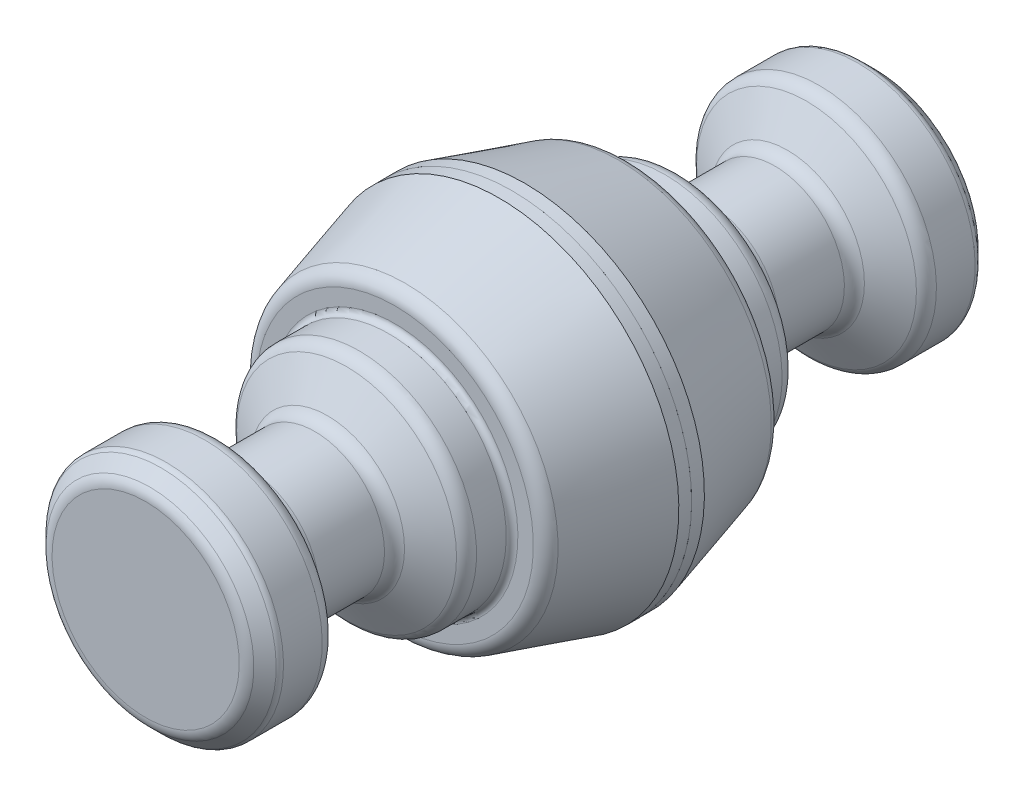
ISO-10303-21;
HEADER;
FILE_DESCRIPTION(('STEP AP214'),'2;1');
FILE_NAME('part.step','',(''),(''),'','','');
FILE_SCHEMA(('AUTOMOTIVE_DESIGN { 1 0 10303 214 1 1 1 1 }'));
ENDSEC;
DATA;
#1=APPLICATION_CONTEXT('core data for automotive mechanical design processes');
#2=APPLICATION_PROTOCOL_DEFINITION('international standard','automotive_design',2000,#1);
#3=PRODUCT_CONTEXT('',#1,'mechanical');
#4=PRODUCT('Part','Part','',(#3));
#5=PRODUCT_RELATED_PRODUCT_CATEGORY('part','',(#4));
#6=PRODUCT_DEFINITION_FORMATION('','',#4);
#7=PRODUCT_DEFINITION_CONTEXT('part definition',#1,'design');
#8=PRODUCT_DEFINITION('design','',#6,#7);
#9=PRODUCT_DEFINITION_SHAPE('','',#8);
#10=(LENGTH_UNIT() NAMED_UNIT(*) SI_UNIT(.MILLI.,.METRE.));
#11=(NAMED_UNIT(*) PLANE_ANGLE_UNIT() SI_UNIT($,.RADIAN.));
#12=(NAMED_UNIT(*) SI_UNIT($,.STERADIAN.) SOLID_ANGLE_UNIT());
#13=UNCERTAINTY_MEASURE_WITH_UNIT(LENGTH_MEASURE(1.E-05),#10,'distance_accuracy_value','');
#14=(GEOMETRIC_REPRESENTATION_CONTEXT(3) GLOBAL_UNCERTAINTY_ASSIGNED_CONTEXT((#13)) GLOBAL_UNIT_ASSIGNED_CONTEXT((#10,
#11,#12)) REPRESENTATION_CONTEXT('',''));
#15=CARTESIAN_POINT('',(0.,0.,0.));
#16=DIRECTION('',(0.,0.,1.));
#17=DIRECTION('',(1.,0.,0.));
#18=AXIS2_PLACEMENT_3D('',#15,#16,#17);
#19=CARTESIAN_POINT('',(0.,0.,0.));
#20=DIRECTION('',(0.,0.,-1.));
#21=DIRECTION('',(0.,-1.,0.));
#22=AXIS2_PLACEMENT_3D('',#19,#20,#21);
#23=CYLINDRICAL_SURFACE('',#22,4.75);
#24=CARTESIAN_POINT('',(0.,0.,13.4537386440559));
#25=DIRECTION('',(0.,0.,-1.));
#26=DIRECTION('',(0.,-1.,0.));
#27=AXIS2_PLACEMENT_3D('',#24,#25,#26);
#28=CIRCLE('',#27,4.75);
#29=CARTESIAN_POINT('',(0.,-4.75,13.4537386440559));
#30=VERTEX_POINT('',#29);
#31=EDGE_CURVE('E85',#30,#30,#28,.F.);
#32=ORIENTED_EDGE('',*,*,#31,.T.);
#33=EDGE_LOOP('',(#32));
#34=FACE_BOUND('',#33,.T.);
#35=CARTESIAN_POINT('',(0.,0.,17.9226497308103));
#36=DIRECTION('',(0.,0.,-1.));
#37=DIRECTION('',(0.,-1.,0.));
#38=AXIS2_PLACEMENT_3D('',#35,#36,#37);
#39=CIRCLE('',#38,4.75);
#40=CARTESIAN_POINT('',(0.,-4.75,17.9226497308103));
#41=VERTEX_POINT('',#40);
#42=EDGE_CURVE('E118',#41,#41,#39,.T.);
#43=ORIENTED_EDGE('',*,*,#42,.T.);
#44=EDGE_LOOP('',(#43));
#45=FACE_BOUND('',#44,.T.);
#46=ADVANCED_FACE('F12',(#34,#45),#23,.T.);
#47=CARTESIAN_POINT('',(0.,0.,0.));
#48=DIRECTION('',(0.,0.,-1.));
#49=DIRECTION('',(0.,-1.,0.));
#50=AXIS2_PLACEMENT_3D('',#47,#48,#49);
#51=CYLINDRICAL_SURFACE('',#50,8.);
#52=CARTESIAN_POINT('',(0.,0.,20.9537386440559));
#53=DIRECTION('',(0.,0.,1.));
#54=DIRECTION('',(0.,1.,0.));
#55=AXIS2_PLACEMENT_3D('',#52,#53,#54);
#56=CIRCLE('',#55,8.);
#57=CARTESIAN_POINT('',(0.,8.,20.9537386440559));
#58=VERTEX_POINT('',#57);
#59=EDGE_CURVE('E8',#58,#58,#56,.T.);
#60=ORIENTED_EDGE('',*,*,#59,.T.);
#61=EDGE_LOOP('',(#60));
#62=FACE_BOUND('',#61,.T.);
#63=CARTESIAN_POINT('',(0.,0.,23.5928932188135));
#64=DIRECTION('',(0.,0.,1.));
#65=DIRECTION('',(0.,1.,0.));
#66=AXIS2_PLACEMENT_3D('',#63,#64,#65);
#67=CIRCLE('',#66,8.);
#68=CARTESIAN_POINT('',(0.,8.,23.5928932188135));
#69=VERTEX_POINT('',#68);
#70=EDGE_CURVE('E112',#69,#69,#67,.F.);
#71=ORIENTED_EDGE('',*,*,#70,.T.);
#72=EDGE_LOOP('',(#71));
#73=FACE_BOUND('',#72,.T.);
#74=ADVANCED_FACE('F174',(#62,#73),#51,.T.);
#75=CARTESIAN_POINT('',(0.,0.,18.5));
#76=DIRECTION('',(0.,0.,1.));
#77=DIRECTION('',(0.,1.,0.));
#78=AXIS2_PLACEMENT_3D('',#75,#76,#77);
#79=CONICAL_SURFACE('',#78,4.75,1.0471975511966);
#80=CARTESIAN_POINT('',(0.,0.,20.0877132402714));
#81=DIRECTION('',(0.,0.,-1.));
#82=DIRECTION('',(0.,-1.,0.));
#83=AXIS2_PLACEMENT_3D('',#80,#81,#82);
#84=CIRCLE('',#83,7.5);
#85=CARTESIAN_POINT('',(0.,-7.5,20.0877132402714));
#86=VERTEX_POINT('',#85);
#87=EDGE_CURVE('E19',#86,#86,#84,.T.);
#88=ORIENTED_EDGE('',*,*,#87,.T.);
#89=EDGE_LOOP('',(#88));
#90=FACE_BOUND('',#89,.T.);
#91=CARTESIAN_POINT('',(0.,0.,18.7886751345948));
#92=DIRECTION('',(0.,0.,1.));
#93=DIRECTION('',(0.,1.,0.));
#94=AXIS2_PLACEMENT_3D('',#91,#92,#93);
#95=CIRCLE('',#94,5.25);
#96=CARTESIAN_POINT('',(0.,5.25,18.7886751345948));
#97=VERTEX_POINT('',#96);
#98=EDGE_CURVE('E115',#97,#97,#95,.T.);
#99=ORIENTED_EDGE('',*,*,#98,.T.);
#100=EDGE_LOOP('',(#99));
#101=FACE_BOUND('',#100,.T.);
#102=ADVANCED_FACE('F181',(#90,#101),#79,.T.);
#103=CARTESIAN_POINT('',(0.,0.,23.8));
#104=DIRECTION('',(0.,0.,-1.));
#105=DIRECTION('',(0.,-1.,0.));
#106=AXIS2_PLACEMENT_3D('',#103,#104,#105);
#107=CONICAL_SURFACE('',#106,8.,0.785398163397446);
#108=CARTESIAN_POINT('',(0.,0.,24.7071067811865));
#109=DIRECTION('',(0.,0.,1.));
#110=DIRECTION('',(0.,1.,0.));
#111=AXIS2_PLACEMENT_3D('',#108,#109,#110);
#112=CIRCLE('',#111,7.09289321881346);
#113=CARTESIAN_POINT('',(0.,7.09289321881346,24.7071067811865));
#114=VERTEX_POINT('',#113);
#115=EDGE_CURVE('E106',#114,#114,#112,.F.);
#116=ORIENTED_EDGE('',*,*,#115,.T.);
#117=EDGE_LOOP('',(#116));
#118=FACE_BOUND('',#117,.T.);
#119=CARTESIAN_POINT('',(0.,0.,23.9464466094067));
#120=DIRECTION('',(0.,0.,1.));
#121=DIRECTION('',(0.,1.,0.));
#122=AXIS2_PLACEMENT_3D('',#119,#120,#121);
#123=CIRCLE('',#122,7.85355339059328);
#124=CARTESIAN_POINT('',(0.,7.85355339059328,23.9464466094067));
#125=VERTEX_POINT('',#124);
#126=EDGE_CURVE('E109',#125,#125,#123,.T.);
#127=ORIENTED_EDGE('',*,*,#126,.T.);
#128=EDGE_LOOP('',(#127));
#129=FACE_BOUND('',#128,.T.);
#130=ADVANCED_FACE('F190',(#118,#129),#107,.T.);
#131=CARTESIAN_POINT('',(-9.,0.,25.));
#132=DIRECTION('',(0.,0.,1.));
#133=DIRECTION('',(0.,1.,0.));
#134=AXIS2_PLACEMENT_3D('',#131,#132,#133);
#135=PLANE('',#134);
#136=CARTESIAN_POINT('',(0.,0.,25.));
#137=DIRECTION('',(0.,0.,1.));
#138=DIRECTION('',(0.,1.,0.));
#139=AXIS2_PLACEMENT_3D('',#136,#137,#138);
#140=CIRCLE('',#139,6.38578643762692);
#141=CARTESIAN_POINT('',(0.,6.38578643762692,25.));
#142=VERTEX_POINT('',#141);
#143=EDGE_CURVE('E103',#142,#142,#140,.T.);
#144=ORIENTED_EDGE('',*,*,#143,.T.);
#145=EDGE_LOOP('',(#144));
#146=FACE_BOUND('',#145,.T.);
#147=ADVANCED_FACE('F186',(#146),#135,.T.);
#148=CARTESIAN_POINT('',(0.,0.,17.9226497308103));
#149=DIRECTION('',(0.,0.,-1.));
#150=DIRECTION('',(0.,-1.,0.));
#151=AXIS2_PLACEMENT_3D('',#148,#149,#150);
#152=TOROIDAL_SURFACE('',#151,5.75,1.);
#153=ORIENTED_EDGE('',*,*,#98,.F.);
#154=EDGE_LOOP('',(#153));
#155=FACE_BOUND('',#154,.T.);
#156=ORIENTED_EDGE('',*,*,#42,.F.);
#157=EDGE_LOOP('',(#156));
#158=FACE_BOUND('',#157,.T.);
#159=ADVANCED_FACE('F189',(#155,#158),#152,.F.);
#160=CARTESIAN_POINT('',(0.,0.,23.5928932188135));
#161=DIRECTION('',(0.,0.,1.));
#162=DIRECTION('',(0.,1.,0.));
#163=AXIS2_PLACEMENT_3D('',#160,#161,#162);
#164=TOROIDAL_SURFACE('',#163,7.5,0.5);
#165=ORIENTED_EDGE('',*,*,#126,.F.);
#166=EDGE_LOOP('',(#165));
#167=FACE_BOUND('',#166,.T.);
#168=ORIENTED_EDGE('',*,*,#70,.F.);
#169=EDGE_LOOP('',(#168));
#170=FACE_BOUND('',#169,.T.);
#171=ADVANCED_FACE('F194',(#167,#170),#164,.T.);
#172=CARTESIAN_POINT('',(0.,0.,24.));
#173=DIRECTION('',(0.,0.,1.));
#174=DIRECTION('',(0.,1.,0.));
#175=AXIS2_PLACEMENT_3D('',#172,#173,#174);
#176=TOROIDAL_SURFACE('',#175,6.38578643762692,1.);
#177=ORIENTED_EDGE('',*,*,#143,.F.);
#178=EDGE_LOOP('',(#177));
#179=FACE_BOUND('',#178,.T.);
#180=ORIENTED_EDGE('',*,*,#115,.F.);
#181=EDGE_LOOP('',(#180));
#182=FACE_BOUND('',#181,.T.);
#183=ADVANCED_FACE('F198',(#179,#182),#176,.T.);
#184=CARTESIAN_POINT('',(0.,0.,12.8763883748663));
#185=DIRECTION('',(0.,0.,-1.));
#186=DIRECTION('',(0.,-1.,0.));
#187=AXIS2_PLACEMENT_3D('',#184,#185,#186);
#188=CONICAL_SURFACE('',#187,4.75,1.0471975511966);
#189=CARTESIAN_POINT('',(0.,0.,11.2886751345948));
#190=DIRECTION('',(0.,0.,1.));
#191=DIRECTION('',(0.,1.,0.));
#192=AXIS2_PLACEMENT_3D('',#189,#190,#191);
#193=CIRCLE('',#192,7.5);
#194=CARTESIAN_POINT('',(0.,7.5,11.2886751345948));
#195=VERTEX_POINT('',#194);
#196=EDGE_CURVE('E88',#195,#195,#193,.T.);
#197=ORIENTED_EDGE('',*,*,#196,.T.);
#198=EDGE_LOOP('',(#197));
#199=FACE_BOUND('',#198,.T.);
#200=CARTESIAN_POINT('',(0.,0.,12.5877132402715));
#201=DIRECTION('',(0.,0.,1.));
#202=DIRECTION('',(0.,1.,0.));
#203=AXIS2_PLACEMENT_3D('',#200,#201,#202);
#204=CIRCLE('',#203,5.25);
#205=CARTESIAN_POINT('',(0.,5.25,12.5877132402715));
#206=VERTEX_POINT('',#205);
#207=EDGE_CURVE('E91',#206,#206,#204,.F.);
#208=ORIENTED_EDGE('',*,*,#207,.T.);
#209=EDGE_LOOP('',(#208));
#210=FACE_BOUND('',#209,.T.);
#211=ADVANCED_FACE('F202',(#199,#210),#188,.T.);
#212=CARTESIAN_POINT('',(0.,0.,0.));
#213=DIRECTION('',(0.,0.,-1.));
#214=DIRECTION('',(0.,-1.,0.));
#215=AXIS2_PLACEMENT_3D('',#212,#213,#214);
#216=CYLINDRICAL_SURFACE('',#215,8.);
#217=CARTESIAN_POINT('',(0.,0.,8.4));
#218=DIRECTION('',(0.,0.,-1.));
#219=DIRECTION('',(0.,-1.,0.));
#220=AXIS2_PLACEMENT_3D('',#217,#218,#219);
#221=CIRCLE('',#220,8.);
#222=CARTESIAN_POINT('',(0.,-8.,8.4));
#223=VERTEX_POINT('',#222);
#224=EDGE_CURVE('E82',#223,#223,#221,.F.);
#225=ORIENTED_EDGE('',*,*,#224,.T.);
#226=EDGE_LOOP('',(#225));
#227=FACE_BOUND('',#226,.T.);
#228=CARTESIAN_POINT('',(0.,0.,10.4226497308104));
#229=DIRECTION('',(0.,0.,1.));
#230=DIRECTION('',(0.,1.,0.));
#231=AXIS2_PLACEMENT_3D('',#228,#229,#230);
#232=CIRCLE('',#231,8.);
#233=CARTESIAN_POINT('',(0.,8.,10.4226497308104));
#234=VERTEX_POINT('',#233);
#235=EDGE_CURVE('E94',#234,#234,#232,.F.);
#236=ORIENTED_EDGE('',*,*,#235,.T.);
#237=EDGE_LOOP('',(#236));
#238=FACE_BOUND('',#237,.T.);
#239=ADVANCED_FACE('F279',(#227,#238),#216,.T.);
#240=CARTESIAN_POINT('',(0.,0.,0.));
#241=DIRECTION('',(0.,0.,-1.));
#242=DIRECTION('',(0.,-1.,0.));
#243=AXIS2_PLACEMENT_3D('',#240,#241,#242);
#244=CYLINDRICAL_SURFACE('',#243,12.25);
#245=CARTESIAN_POINT('',(0.,0.,0.));
#246=DIRECTION('',(0.,0.,1.));
#247=DIRECTION('',(0.,1.,0.));
#248=AXIS2_PLACEMENT_3D('',#245,#246,#247);
#249=CIRCLE('',#248,12.25);
#250=CARTESIAN_POINT('',(0.,12.25,0.));
#251=VERTEX_POINT('',#250);
#252=EDGE_CURVE('E125',#251,#251,#249,.T.);
#253=ORIENTED_EDGE('',*,*,#252,.T.);
#254=EDGE_LOOP('',(#253));
#255=FACE_BOUND('',#254,.T.);
#256=CARTESIAN_POINT('',(0.,0.,0.871853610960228));
#257=DIRECTION('',(0.,0.,-1.));
#258=DIRECTION('',(0.,-1.,0.));
#259=AXIS2_PLACEMENT_3D('',#256,#257,#258);
#260=CIRCLE('',#259,12.25);
#261=CARTESIAN_POINT('',(0.,-12.25,0.871853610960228));
#262=VERTEX_POINT('',#261);
#263=EDGE_CURVE('E36',#262,#262,#260,.T.);
#264=ORIENTED_EDGE('',*,*,#263,.T.);
#265=EDGE_LOOP('',(#264));
#266=FACE_BOUND('',#265,.T.);
#267=ADVANCED_FACE('F129',(#255,#266),#244,.T.);
#268=CARTESIAN_POINT('',(0.,0.,8.));
#269=DIRECTION('',(0.,0.,-1.));
#270=DIRECTION('',(0.,-1.,0.));
#271=AXIS2_PLACEMENT_3D('',#268,#269,#270);
#272=CONICAL_SURFACE('',#271,10.2060369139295,0.279252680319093);
#273=CARTESIAN_POINT('',(0.,0.,7.275637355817));
#274=DIRECTION('',(0.,0.,1.));
#275=DIRECTION('',(0.,1.,0.));
#276=AXIS2_PLACEMENT_3D('',#273,#274,#275);
#277=CIRCLE('',#276,10.4137445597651);
#278=CARTESIAN_POINT('',(0.,10.4137445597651,7.275637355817));
#279=VERTEX_POINT('',#278);
#280=EDGE_CURVE('E100',#279,#279,#277,.F.);
#281=ORIENTED_EDGE('',*,*,#280,.T.);
#282=EDGE_LOOP('',(#281));
#283=FACE_BOUND('',#282,.T.);
#284=ORIENTED_EDGE('',*,*,#263,.F.);
#285=EDGE_LOOP('',(#284));
#286=FACE_BOUND('',#285,.T.);
#287=ADVANCED_FACE('F208',(#283,#286),#272,.T.);
#288=CARTESIAN_POINT('',(0.,0.,7.));
#289=DIRECTION('',(0.,0.,-1.));
#290=DIRECTION('',(0.,-1.,0.));
#291=AXIS2_PLACEMENT_3D('',#288,#289,#290);
#292=TOROIDAL_SURFACE('',#291,9.45248286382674,1.);
#293=CARTESIAN_POINT('',(0.,0.,8.));
#294=DIRECTION('',(0.,0.,-1.));
#295=DIRECTION('',(0.,-1.,0.));
#296=AXIS2_PLACEMENT_3D('',#293,#294,#295);
#297=CIRCLE('',#296,9.45248286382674);
#298=CARTESIAN_POINT('',(0.,-9.45248286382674,8.));
#299=VERTEX_POINT('',#298);
#300=EDGE_CURVE('E97',#299,#299,#297,.F.);
#301=ORIENTED_EDGE('',*,*,#300,.F.);
#302=EDGE_LOOP('',(#301));
#303=FACE_BOUND('',#302,.T.);
#304=ORIENTED_EDGE('',*,*,#280,.F.);
#305=EDGE_LOOP('',(#304));
#306=FACE_BOUND('',#305,.T.);
#307=ADVANCED_FACE('F204',(#303,#306),#292,.T.);
#308=CARTESIAN_POINT('',(-10.2060369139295,0.,8.));
#309=DIRECTION('',(0.,0.,-1.));
#310=DIRECTION('',(0.,-1.,0.));
#311=AXIS2_PLACEMENT_3D('',#308,#309,#310);
#312=PLANE('',#311);
#313=CARTESIAN_POINT('',(0.,0.,8.));
#314=DIRECTION('',(0.,0.,-1.));
#315=DIRECTION('',(0.,-1.,0.));
#316=AXIS2_PLACEMENT_3D('',#313,#314,#315);
#317=CIRCLE('',#316,8.4);
#318=CARTESIAN_POINT('',(0.,-8.4,8.));
#319=VERTEX_POINT('',#318);
#320=EDGE_CURVE('E79',#319,#319,#317,.T.);
#321=ORIENTED_EDGE('',*,*,#320,.T.);
#322=EDGE_LOOP('',(#321));
#323=FACE_BOUND('',#322,.T.);
#324=ORIENTED_EDGE('',*,*,#300,.T.);
#325=EDGE_LOOP('',(#324));
#326=FACE_BOUND('',#325,.T.);
#327=ADVANCED_FACE('F207',(#323,#326),#312,.F.);
#328=CARTESIAN_POINT('',(0.,0.,10.4226497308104));
#329=DIRECTION('',(0.,0.,1.));
#330=DIRECTION('',(0.,1.,0.));
#331=AXIS2_PLACEMENT_3D('',#328,#329,#330);
#332=TOROIDAL_SURFACE('',#331,7.,1.);
#333=ORIENTED_EDGE('',*,*,#196,.F.);
#334=EDGE_LOOP('',(#333));
#335=FACE_BOUND('',#334,.T.);
#336=ORIENTED_EDGE('',*,*,#235,.F.);
#337=EDGE_LOOP('',(#336));
#338=FACE_BOUND('',#337,.T.);
#339=ADVANCED_FACE('F210',(#335,#338),#332,.T.);
#340=CARTESIAN_POINT('',(0.,0.,13.4537386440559));
#341=DIRECTION('',(0.,0.,-1.));
#342=DIRECTION('',(0.,-1.,0.));
#343=AXIS2_PLACEMENT_3D('',#340,#341,#342);
#344=TOROIDAL_SURFACE('',#343,5.75,1.);
#345=ORIENTED_EDGE('',*,*,#31,.F.);
#346=EDGE_LOOP('',(#345));
#347=FACE_BOUND('',#346,.T.);
#348=ORIENTED_EDGE('',*,*,#207,.F.);
#349=EDGE_LOOP('',(#348));
#350=FACE_BOUND('',#349,.T.);
#351=ADVANCED_FACE('F213',(#347,#350),#344,.F.);
#352=CARTESIAN_POINT('',(0.,0.,8.4));
#353=DIRECTION('',(0.,0.,-1.));
#354=DIRECTION('',(0.,-1.,0.));
#355=AXIS2_PLACEMENT_3D('',#352,#353,#354);
#356=TOROIDAL_SURFACE('',#355,8.4,0.4);
#357=ORIENTED_EDGE('',*,*,#320,.F.);
#358=EDGE_LOOP('',(#357));
#359=FACE_BOUND('',#358,.T.);
#360=ORIENTED_EDGE('',*,*,#224,.F.);
#361=EDGE_LOOP('',(#360));
#362=FACE_BOUND('',#361,.T.);
#363=ADVANCED_FACE('F142',(#359,#362),#356,.F.);
#364=CARTESIAN_POINT('',(0.,0.,0.));
#365=DIRECTION('',(0.,0.,1.));
#366=DIRECTION('',(0.,1.,0.));
#367=AXIS2_PLACEMENT_3D('',#364,#365,#366);
#368=CYLINDRICAL_SURFACE('',#367,12.2495);
#369=CARTESIAN_POINT('',(0.,0.,0.));
#370=DIRECTION('',(0.,0.,1.));
#371=DIRECTION('',(0.,1.,0.));
#372=AXIS2_PLACEMENT_3D('',#369,#370,#371);
#373=CIRCLE('',#372,12.2495);
#374=CARTESIAN_POINT('',(0.,12.2495,0.));
#375=VERTEX_POINT('',#374);
#376=EDGE_CURVE('E37',#375,#375,#373,.T.);
#377=ORIENTED_EDGE('',*,*,#376,.F.);
#378=EDGE_LOOP('',(#377));
#379=FACE_BOUND('',#378,.T.);
#380=CARTESIAN_POINT('',(0.,0.,-0.87359731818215));
#381=DIRECTION('',(0.,0.,1.));
#382=DIRECTION('',(0.,1.,0.));
#383=AXIS2_PLACEMENT_3D('',#380,#381,#382);
#384=CIRCLE('',#383,12.2495);
#385=CARTESIAN_POINT('',(0.,12.2495,-0.87359731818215));
#386=VERTEX_POINT('',#385);
#387=EDGE_CURVE('E33',#386,#386,#384,.F.);
#388=ORIENTED_EDGE('',*,*,#387,.F.);
#389=EDGE_LOOP('',(#388));
#390=FACE_BOUND('',#389,.T.);
#391=ADVANCED_FACE('F136',(#379,#390),#368,.T.);
#392=CARTESIAN_POINT('',(-12.25,0.,0.));
#393=DIRECTION('',(0.,0.,1.));
#394=DIRECTION('',(0.,1.,0.));
#395=AXIS2_PLACEMENT_3D('',#392,#393,#394);
#396=PLANE('',#395);
#397=ORIENTED_EDGE('',*,*,#252,.F.);
#398=EDGE_LOOP('',(#397));
#399=FACE_BOUND('',#398,.T.);
#400=ORIENTED_EDGE('',*,*,#376,.T.);
#401=EDGE_LOOP('',(#400));
#402=FACE_BOUND('',#401,.T.);
#403=ADVANCED_FACE('F132',(#399,#402),#396,.F.);
#404=CARTESIAN_POINT('',(-9.,0.,-25.));
#405=DIRECTION('',(0.,0.,-1.));
#406=DIRECTION('',(0.,1.,0.));
#407=AXIS2_PLACEMENT_3D('',#404,#405,#406);
#408=PLANE('',#407);
#409=CARTESIAN_POINT('',(0.,0.,-25.));
#410=DIRECTION('',(0.,0.,-1.));
#411=DIRECTION('',(0.,-1.,0.));
#412=AXIS2_PLACEMENT_3D('',#409,#410,#411);
#413=CIRCLE('',#412,6.38578643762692);
#414=CARTESIAN_POINT('',(0.,-6.38578643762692,-25.));
#415=VERTEX_POINT('',#414);
#416=EDGE_CURVE('E64',#415,#415,#413,.T.);
#417=ORIENTED_EDGE('',*,*,#416,.T.);
#418=EDGE_LOOP('',(#417));
#419=FACE_BOUND('',#418,.T.);
#420=ADVANCED_FACE('F135',(#419),#408,.T.);
#421=CARTESIAN_POINT('',(0.,0.,-24.));
#422=DIRECTION('',(0.,0.,-1.));
#423=DIRECTION('',(0.,-1.,0.));
#424=AXIS2_PLACEMENT_3D('',#421,#422,#423);
#425=TOROIDAL_SURFACE('',#424,6.38578643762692,1.);
#426=CARTESIAN_POINT('',(0.,0.,-24.7071067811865));
#427=DIRECTION('',(0.,0.,-1.));
#428=DIRECTION('',(0.,-1.,0.));
#429=AXIS2_PLACEMENT_3D('',#426,#427,#428);
#430=CIRCLE('',#429,7.09289321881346);
#431=CARTESIAN_POINT('',(0.,-7.09289321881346,-24.7071067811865));
#432=VERTEX_POINT('',#431);
#433=EDGE_CURVE('E61',#432,#432,#430,.F.);
#434=ORIENTED_EDGE('',*,*,#433,.F.);
#435=EDGE_LOOP('',(#434));
#436=FACE_BOUND('',#435,.T.);
#437=ORIENTED_EDGE('',*,*,#416,.F.);
#438=EDGE_LOOP('',(#437));
#439=FACE_BOUND('',#438,.T.);
#440=ADVANCED_FACE('F233',(#436,#439),#425,.T.);
#441=CARTESIAN_POINT('',(0.,0.,-23.8));
#442=DIRECTION('',(0.,0.,1.));
#443=DIRECTION('',(0.,-1.,0.));
#444=AXIS2_PLACEMENT_3D('',#441,#442,#443);
#445=CONICAL_SURFACE('',#444,8.,0.785398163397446);
#446=ORIENTED_EDGE('',*,*,#433,.T.);
#447=EDGE_LOOP('',(#446));
#448=FACE_BOUND('',#447,.T.);
#449=CARTESIAN_POINT('',(0.,0.,-23.9464466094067));
#450=DIRECTION('',(0.,0.,-1.));
#451=DIRECTION('',(0.,-1.,0.));
#452=AXIS2_PLACEMENT_3D('',#449,#450,#451);
#453=CIRCLE('',#452,7.85355339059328);
#454=CARTESIAN_POINT('',(0.,-7.85355339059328,-23.9464466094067));
#455=VERTEX_POINT('',#454);
#456=EDGE_CURVE('E70',#455,#455,#453,.T.);
#457=ORIENTED_EDGE('',*,*,#456,.T.);
#458=EDGE_LOOP('',(#457));
#459=FACE_BOUND('',#458,.T.);
#460=ADVANCED_FACE('F231',(#448,#459),#445,.T.);
#461=CARTESIAN_POINT('',(0.,0.,-23.5928932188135));
#462=DIRECTION('',(0.,0.,1.));
#463=DIRECTION('',(0.,1.,0.));
#464=AXIS2_PLACEMENT_3D('',#461,#462,#463);
#465=TOROIDAL_SURFACE('',#464,7.5,0.5);
#466=CARTESIAN_POINT('',(0.,0.,-23.5928932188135));
#467=DIRECTION('',(0.,0.,1.));
#468=DIRECTION('',(0.,1.,0.));
#469=AXIS2_PLACEMENT_3D('',#466,#467,#468);
#470=CIRCLE('',#469,8.);
#471=CARTESIAN_POINT('',(0.,8.,-23.5928932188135));
#472=VERTEX_POINT('',#471);
#473=EDGE_CURVE('E67',#472,#472,#470,.T.);
#474=ORIENTED_EDGE('',*,*,#473,.F.);
#475=EDGE_LOOP('',(#474));
#476=FACE_BOUND('',#475,.T.);
#477=ORIENTED_EDGE('',*,*,#456,.F.);
#478=EDGE_LOOP('',(#477));
#479=FACE_BOUND('',#478,.T.);
#480=ADVANCED_FACE('F227',(#476,#479),#465,.T.);
#481=CARTESIAN_POINT('',(0.,0.,0.));
#482=DIRECTION('',(0.,0.,1.));
#483=DIRECTION('',(0.,-1.,0.));
#484=AXIS2_PLACEMENT_3D('',#481,#482,#483);
#485=CYLINDRICAL_SURFACE('',#484,8.);
#486=CARTESIAN_POINT('',(0.,0.,-20.9537386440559));
#487=DIRECTION('',(0.,0.,1.));
#488=DIRECTION('',(0.,1.,0.));
#489=AXIS2_PLACEMENT_3D('',#486,#487,#488);
#490=CIRCLE('',#489,8.);
#491=CARTESIAN_POINT('',(0.,8.,-20.9537386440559));
#492=VERTEX_POINT('',#491);
#493=EDGE_CURVE('E27',#492,#492,#490,.F.);
#494=ORIENTED_EDGE('',*,*,#493,.T.);
#495=EDGE_LOOP('',(#494));
#496=FACE_BOUND('',#495,.T.);
#497=ORIENTED_EDGE('',*,*,#473,.T.);
#498=EDGE_LOOP('',(#497));
#499=FACE_BOUND('',#498,.T.);
#500=ADVANCED_FACE('F230',(#496,#499),#485,.T.);
#501=CARTESIAN_POINT('',(0.,0.,-18.5));
#502=DIRECTION('',(0.,0.,-1.));
#503=DIRECTION('',(0.,1.,0.));
#504=AXIS2_PLACEMENT_3D('',#501,#502,#503);
#505=CONICAL_SURFACE('',#504,4.75,1.0471975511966);
#506=CARTESIAN_POINT('',(0.,0.,-20.0877132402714));
#507=DIRECTION('',(0.,0.,1.));
#508=DIRECTION('',(0.,1.,0.));
#509=AXIS2_PLACEMENT_3D('',#506,#507,#508);
#510=CIRCLE('',#509,7.5);
#511=CARTESIAN_POINT('',(0.,7.5,-20.0877132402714));
#512=VERTEX_POINT('',#511);
#513=EDGE_CURVE('E23',#512,#512,#510,.T.);
#514=ORIENTED_EDGE('',*,*,#513,.T.);
#515=EDGE_LOOP('',(#514));
#516=FACE_BOUND('',#515,.T.);
#517=CARTESIAN_POINT('',(0.,0.,-18.7886751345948));
#518=DIRECTION('',(0.,0.,-1.));
#519=DIRECTION('',(0.,-1.,0.));
#520=AXIS2_PLACEMENT_3D('',#517,#518,#519);
#521=CIRCLE('',#520,5.25);
#522=CARTESIAN_POINT('',(0.,-5.25,-18.7886751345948));
#523=VERTEX_POINT('',#522);
#524=EDGE_CURVE('E76',#523,#523,#521,.T.);
#525=ORIENTED_EDGE('',*,*,#524,.T.);
#526=EDGE_LOOP('',(#525));
#527=FACE_BOUND('',#526,.T.);
#528=ADVANCED_FACE('F225',(#516,#527),#505,.T.);
#529=CARTESIAN_POINT('',(0.,0.,-17.9226497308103));
#530=DIRECTION('',(0.,0.,-1.));
#531=DIRECTION('',(0.,-1.,0.));
#532=AXIS2_PLACEMENT_3D('',#529,#530,#531);
#533=TOROIDAL_SURFACE('',#532,5.75,1.);
#534=CARTESIAN_POINT('',(0.,0.,-17.9226497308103));
#535=DIRECTION('',(0.,0.,-1.));
#536=DIRECTION('',(0.,-1.,0.));
#537=AXIS2_PLACEMENT_3D('',#534,#535,#536);
#538=CIRCLE('',#537,4.75);
#539=CARTESIAN_POINT('',(0.,-4.75,-17.9226497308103));
#540=VERTEX_POINT('',#539);
#541=EDGE_CURVE('E73',#540,#540,#538,.F.);
#542=ORIENTED_EDGE('',*,*,#541,.F.);
#543=EDGE_LOOP('',(#542));
#544=FACE_BOUND('',#543,.T.);
#545=ORIENTED_EDGE('',*,*,#524,.F.);
#546=EDGE_LOOP('',(#545));
#547=FACE_BOUND('',#546,.T.);
#548=ADVANCED_FACE('F221',(#544,#547),#533,.F.);
#549=CARTESIAN_POINT('',(0.,0.,0.));
#550=DIRECTION('',(0.,0.,1.));
#551=DIRECTION('',(0.,-1.,0.));
#552=AXIS2_PLACEMENT_3D('',#549,#550,#551);
#553=CYLINDRICAL_SURFACE('',#552,4.75);
#554=CARTESIAN_POINT('',(0.,0.,-13.4537386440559));
#555=DIRECTION('',(0.,0.,-1.));
#556=DIRECTION('',(0.,-1.,0.));
#557=AXIS2_PLACEMENT_3D('',#554,#555,#556);
#558=CIRCLE('',#557,4.75);
#559=CARTESIAN_POINT('',(0.,-4.75,-13.4537386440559));
#560=VERTEX_POINT('',#559);
#561=EDGE_CURVE('E43',#560,#560,#558,.T.);
#562=ORIENTED_EDGE('',*,*,#561,.T.);
#563=EDGE_LOOP('',(#562));
#564=FACE_BOUND('',#563,.T.);
#565=ORIENTED_EDGE('',*,*,#541,.T.);
#566=EDGE_LOOP('',(#565));
#567=FACE_BOUND('',#566,.T.);
#568=ADVANCED_FACE('F224',(#564,#567),#553,.T.);
#569=CARTESIAN_POINT('',(0.,0.,-13.4537386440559));
#570=DIRECTION('',(0.,0.,-1.));
#571=DIRECTION('',(0.,-1.,0.));
#572=AXIS2_PLACEMENT_3D('',#569,#570,#571);
#573=TOROIDAL_SURFACE('',#572,5.75,1.);
#574=CARTESIAN_POINT('',(0.,0.,-12.5877132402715));
#575=DIRECTION('',(0.,0.,-1.));
#576=DIRECTION('',(0.,-1.,0.));
#577=AXIS2_PLACEMENT_3D('',#574,#575,#576);
#578=CIRCLE('',#577,5.25);
#579=CARTESIAN_POINT('',(0.,-5.25,-12.5877132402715));
#580=VERTEX_POINT('',#579);
#581=EDGE_CURVE('E52',#580,#580,#578,.F.);
#582=ORIENTED_EDGE('',*,*,#581,.F.);
#583=EDGE_LOOP('',(#582));
#584=FACE_BOUND('',#583,.T.);
#585=ORIENTED_EDGE('',*,*,#561,.F.);
#586=EDGE_LOOP('',(#585));
#587=FACE_BOUND('',#586,.T.);
#588=ADVANCED_FACE('F242',(#584,#587),#573,.F.);
#589=CARTESIAN_POINT('',(0.,0.,-12.8763883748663));
#590=DIRECTION('',(0.,0.,1.));
#591=DIRECTION('',(0.,-1.,0.));
#592=AXIS2_PLACEMENT_3D('',#589,#590,#591);
#593=CONICAL_SURFACE('',#592,4.75,1.0471975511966);
#594=CARTESIAN_POINT('',(0.,0.,-11.2886751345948));
#595=DIRECTION('',(0.,0.,-1.));
#596=DIRECTION('',(0.,-1.,0.));
#597=AXIS2_PLACEMENT_3D('',#594,#595,#596);
#598=CIRCLE('',#597,7.5);
#599=CARTESIAN_POINT('',(0.,-7.5,-11.2886751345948));
#600=VERTEX_POINT('',#599);
#601=EDGE_CURVE('E49',#600,#600,#598,.T.);
#602=ORIENTED_EDGE('',*,*,#601,.T.);
#603=EDGE_LOOP('',(#602));
#604=FACE_BOUND('',#603,.T.);
#605=ORIENTED_EDGE('',*,*,#581,.T.);
#606=EDGE_LOOP('',(#605));
#607=FACE_BOUND('',#606,.T.);
#608=ADVANCED_FACE('F240',(#604,#607),#593,.T.);
#609=CARTESIAN_POINT('',(0.,0.,-10.4226497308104));
#610=DIRECTION('',(0.,0.,1.));
#611=DIRECTION('',(0.,1.,0.));
#612=AXIS2_PLACEMENT_3D('',#609,#610,#611);
#613=TOROIDAL_SURFACE('',#612,7.,1.);
#614=CARTESIAN_POINT('',(0.,0.,-10.4226497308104));
#615=DIRECTION('',(0.,0.,1.));
#616=DIRECTION('',(0.,1.,0.));
#617=AXIS2_PLACEMENT_3D('',#614,#615,#616);
#618=CIRCLE('',#617,8.);
#619=CARTESIAN_POINT('',(0.,8.,-10.4226497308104));
#620=VERTEX_POINT('',#619);
#621=EDGE_CURVE('E46',#620,#620,#618,.T.);
#622=ORIENTED_EDGE('',*,*,#621,.F.);
#623=EDGE_LOOP('',(#622));
#624=FACE_BOUND('',#623,.T.);
#625=ORIENTED_EDGE('',*,*,#601,.F.);
#626=EDGE_LOOP('',(#625));
#627=FACE_BOUND('',#626,.T.);
#628=ADVANCED_FACE('F237',(#624,#627),#613,.T.);
#629=CARTESIAN_POINT('',(0.,0.,0.));
#630=DIRECTION('',(0.,0.,1.));
#631=DIRECTION('',(0.,-1.,0.));
#632=AXIS2_PLACEMENT_3D('',#629,#630,#631);
#633=CYLINDRICAL_SURFACE('',#632,8.);
#634=CARTESIAN_POINT('',(0.,0.,-8.4));
#635=DIRECTION('',(0.,0.,1.));
#636=DIRECTION('',(0.,1.,0.));
#637=AXIS2_PLACEMENT_3D('',#634,#635,#636);
#638=CIRCLE('',#637,8.);
#639=CARTESIAN_POINT('',(0.,8.,-8.4));
#640=VERTEX_POINT('',#639);
#641=EDGE_CURVE('E40',#640,#640,#638,.F.);
#642=ORIENTED_EDGE('',*,*,#641,.T.);
#643=EDGE_LOOP('',(#642));
#644=FACE_BOUND('',#643,.T.);
#645=ORIENTED_EDGE('',*,*,#621,.T.);
#646=EDGE_LOOP('',(#645));
#647=FACE_BOUND('',#646,.T.);
#648=ADVANCED_FACE('F169',(#644,#647),#633,.T.);
#649=CARTESIAN_POINT('',(0.,0.,-8.4));
#650=DIRECTION('',(0.,0.,1.));
#651=DIRECTION('',(0.,1.,0.));
#652=AXIS2_PLACEMENT_3D('',#649,#650,#651);
#653=TOROIDAL_SURFACE('',#652,8.4,0.4);
#654=CARTESIAN_POINT('',(0.,0.,-8.));
#655=DIRECTION('',(0.,0.,1.));
#656=DIRECTION('',(0.,1.,0.));
#657=AXIS2_PLACEMENT_3D('',#654,#655,#656);
#658=CIRCLE('',#657,8.4);
#659=CARTESIAN_POINT('',(0.,8.4,-8.));
#660=VERTEX_POINT('',#659);
#661=EDGE_CURVE('E32',#660,#660,#658,.T.);
#662=ORIENTED_EDGE('',*,*,#661,.F.);
#663=EDGE_LOOP('',(#662));
#664=FACE_BOUND('',#663,.T.);
#665=ORIENTED_EDGE('',*,*,#641,.F.);
#666=EDGE_LOOP('',(#665));
#667=FACE_BOUND('',#666,.T.);
#668=ADVANCED_FACE('F161',(#664,#667),#653,.F.);
#669=CARTESIAN_POINT('',(-10.2060369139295,0.,-8.));
#670=DIRECTION('',(0.,0.,1.));
#671=DIRECTION('',(0.,-1.,0.));
#672=AXIS2_PLACEMENT_3D('',#669,#670,#671);
#673=PLANE('',#672);
#674=ORIENTED_EDGE('',*,*,#661,.T.);
#675=EDGE_LOOP('',(#674));
#676=FACE_BOUND('',#675,.T.);
#677=CARTESIAN_POINT('',(0.,0.,-8.));
#678=DIRECTION('',(0.,0.,1.));
#679=DIRECTION('',(0.,1.,0.));
#680=AXIS2_PLACEMENT_3D('',#677,#678,#679);
#681=CIRCLE('',#680,9.45248286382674);
#682=CARTESIAN_POINT('',(0.,9.45248286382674,-8.));
#683=VERTEX_POINT('',#682);
#684=EDGE_CURVE('E58',#683,#683,#681,.F.);
#685=ORIENTED_EDGE('',*,*,#684,.T.);
#686=EDGE_LOOP('',(#685));
#687=FACE_BOUND('',#686,.T.);
#688=ADVANCED_FACE('F156',(#676,#687),#673,.F.);
#689=CARTESIAN_POINT('',(0.,0.,-7.));
#690=DIRECTION('',(0.,0.,1.));
#691=DIRECTION('',(0.,1.,0.));
#692=AXIS2_PLACEMENT_3D('',#689,#690,#691);
#693=TOROIDAL_SURFACE('',#692,9.45248286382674,1.);
#694=CARTESIAN_POINT('',(0.,0.,-7.275637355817));
#695=DIRECTION('',(0.,0.,-1.));
#696=DIRECTION('',(0.,-1.,0.));
#697=AXIS2_PLACEMENT_3D('',#694,#695,#696);
#698=CIRCLE('',#697,10.4137445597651);
#699=CARTESIAN_POINT('',(0.,-10.4137445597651,-7.275637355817));
#700=VERTEX_POINT('',#699);
#701=EDGE_CURVE('E55',#700,#700,#698,.F.);
#702=ORIENTED_EDGE('',*,*,#701,.F.);
#703=EDGE_LOOP('',(#702));
#704=FACE_BOUND('',#703,.T.);
#705=ORIENTED_EDGE('',*,*,#684,.F.);
#706=EDGE_LOOP('',(#705));
#707=FACE_BOUND('',#706,.T.);
#708=ADVANCED_FACE('F150',(#704,#707),#693,.T.);
#709=CARTESIAN_POINT('',(0.,0.,-8.));
#710=DIRECTION('',(0.,0.,1.));
#711=DIRECTION('',(0.,-1.,0.));
#712=AXIS2_PLACEMENT_3D('',#709,#710,#711);
#713=CONICAL_SURFACE('',#712,10.2060369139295,0.279252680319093);
#714=ORIENTED_EDGE('',*,*,#387,.T.);
#715=EDGE_LOOP('',(#714));
#716=FACE_BOUND('',#715,.T.);
#717=ORIENTED_EDGE('',*,*,#701,.T.);
#718=EDGE_LOOP('',(#717));
#719=FACE_BOUND('',#718,.T.);
#720=ADVANCED_FACE('F146',(#716,#719),#713,.T.);
#721=CARTESIAN_POINT('',(0.,0.,-20.9537386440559));
#722=DIRECTION('',(0.,0.,1.));
#723=DIRECTION('',(0.,1.,0.));
#724=AXIS2_PLACEMENT_3D('',#721,#722,#723);
#725=TOROIDAL_SURFACE('',#724,7.,1.);
#726=ORIENTED_EDGE('',*,*,#513,.F.);
#727=EDGE_LOOP('',(#726));
#728=FACE_BOUND('',#727,.T.);
#729=ORIENTED_EDGE('',*,*,#493,.F.);
#730=EDGE_LOOP('',(#729));
#731=FACE_BOUND('',#730,.T.);
#732=ADVANCED_FACE('F149',(#728,#731),#725,.T.);
#733=CARTESIAN_POINT('',(0.,0.,20.9537386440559));
#734=DIRECTION('',(0.,0.,1.));
#735=DIRECTION('',(0.,1.,0.));
#736=AXIS2_PLACEMENT_3D('',#733,#734,#735);
#737=TOROIDAL_SURFACE('',#736,7.,1.);
#738=ORIENTED_EDGE('',*,*,#59,.F.);
#739=EDGE_LOOP('',(#738));
#740=FACE_BOUND('',#739,.T.);
#741=ORIENTED_EDGE('',*,*,#87,.F.);
#742=EDGE_LOOP('',(#741));
#743=FACE_BOUND('',#742,.T.);
#744=ADVANCED_FACE('F14',(#740,#743),#737,.T.);
#745=CLOSED_SHELL('',(#46,#74,#102,#130,#147,#159,#171,#183,#211,#239,#267,#287,#307,#327,#339,
#351,#363,#391,#403,#420,#440,#460,#480,#500,#528,#548,#568,#588,#608,#628,#648,#668,#688,#708,
#720,#732,#744));
#746=MANIFOLD_SOLID_BREP('B1',#745);
#747=ADVANCED_BREP_SHAPE_REPRESENTATION('',(#18,#746),#14);
#748=SHAPE_DEFINITION_REPRESENTATION(#9,#747);
ENDSEC;
END-ISO-10303-21;
